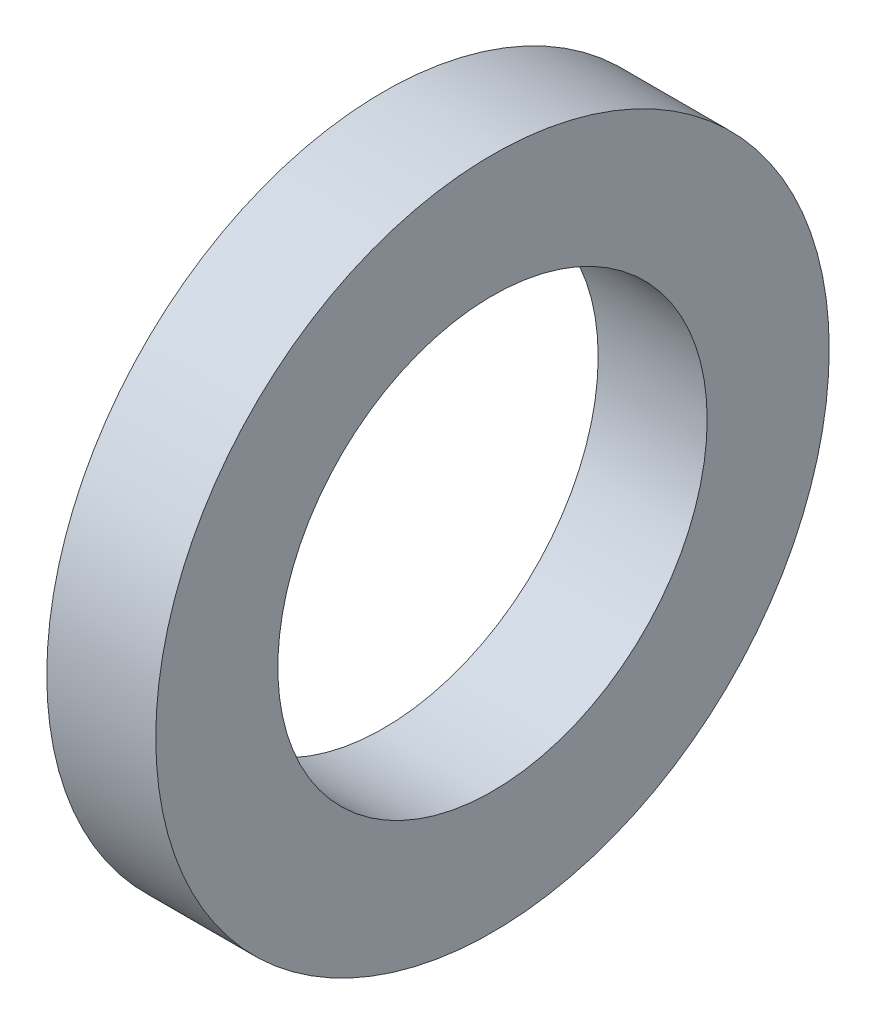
ISO-10303-21;
HEADER;
FILE_DESCRIPTION(('STEP AP214'),'2;1');
FILE_NAME('part.step','',(''),(''),'','','');
FILE_SCHEMA(('AUTOMOTIVE_DESIGN { 1 0 10303 214 1 1 1 1 }'));
ENDSEC;
DATA;
#1=APPLICATION_CONTEXT('core data for automotive mechanical design processes');
#2=APPLICATION_PROTOCOL_DEFINITION('international standard','automotive_design',2000,#1);
#3=PRODUCT_CONTEXT('',#1,'mechanical');
#4=PRODUCT('Part','Part','',(#3));
#5=PRODUCT_RELATED_PRODUCT_CATEGORY('part','',(#4));
#6=PRODUCT_DEFINITION_FORMATION('','',#4);
#7=PRODUCT_DEFINITION_CONTEXT('part definition',#1,'design');
#8=PRODUCT_DEFINITION('design','',#6,#7);
#9=PRODUCT_DEFINITION_SHAPE('','',#8);
#10=(LENGTH_UNIT() NAMED_UNIT(*) SI_UNIT(.MILLI.,.METRE.));
#11=(NAMED_UNIT(*) PLANE_ANGLE_UNIT() SI_UNIT($,.RADIAN.));
#12=(NAMED_UNIT(*) SI_UNIT($,.STERADIAN.) SOLID_ANGLE_UNIT());
#13=UNCERTAINTY_MEASURE_WITH_UNIT(LENGTH_MEASURE(1.E-05),#10,'distance_accuracy_value','');
#14=(GEOMETRIC_REPRESENTATION_CONTEXT(3) GLOBAL_UNCERTAINTY_ASSIGNED_CONTEXT((#13)) GLOBAL_UNIT_ASSIGNED_CONTEXT((#10,
#11,#12)) REPRESENTATION_CONTEXT('',''));
#15=CARTESIAN_POINT('',(0.,0.,0.));
#16=DIRECTION('',(0.,0.,1.));
#17=DIRECTION('',(1.,0.,0.));
#18=AXIS2_PLACEMENT_3D('',#15,#16,#17);
#19=CARTESIAN_POINT('',(6.35,0.,0.));
#20=DIRECTION('',(1.,0.,0.));
#21=DIRECTION('',(0.,0.,-1.));
#22=AXIS2_PLACEMENT_3D('',#19,#20,#21);
#23=PLANE('',#22);
#24=CARTESIAN_POINT('',(6.35,0.,0.));
#25=DIRECTION('',(1.,0.,0.));
#26=DIRECTION('',(0.,0.,-1.));
#27=AXIS2_PLACEMENT_3D('',#24,#25,#26);
#28=CIRCLE('',#27,19.6215);
#29=CARTESIAN_POINT('',(6.35,0.,-19.6215));
#30=VERTEX_POINT('',#29);
#31=EDGE_CURVE('E10',#30,#30,#28,.T.);
#32=ORIENTED_EDGE('',*,*,#31,.T.);
#33=EDGE_LOOP('',(#32));
#34=FACE_BOUND('',#33,.T.);
#35=CARTESIAN_POINT('',(6.35,0.,0.));
#36=DIRECTION('',(1.,0.,0.));
#37=DIRECTION('',(0.,0.,-1.));
#38=AXIS2_PLACEMENT_3D('',#35,#36,#37);
#39=CIRCLE('',#38,12.5095);
#40=CARTESIAN_POINT('',(6.35,0.,-12.5095));
#41=VERTEX_POINT('',#40);
#42=EDGE_CURVE('E41',#41,#41,#39,.T.);
#43=ORIENTED_EDGE('',*,*,#42,.F.);
#44=EDGE_LOOP('',(#43));
#45=FACE_BOUND('',#44,.T.);
#46=ADVANCED_FACE('F30',(#34,#45),#23,.T.);
#47=CARTESIAN_POINT('',(0.,0.,0.));
#48=DIRECTION('',(1.,0.,0.));
#49=DIRECTION('',(0.,0.,-1.));
#50=AXIS2_PLACEMENT_3D('',#47,#48,#49);
#51=PLANE('',#50);
#52=CARTESIAN_POINT('',(0.,0.,0.));
#53=DIRECTION('',(1.,0.,0.));
#54=DIRECTION('',(0.,0.,-1.));
#55=AXIS2_PLACEMENT_3D('',#52,#53,#54);
#56=CIRCLE('',#55,19.6215);
#57=CARTESIAN_POINT('',(0.,0.,-19.6215));
#58=VERTEX_POINT('',#57);
#59=EDGE_CURVE('E37',#58,#58,#56,.T.);
#60=ORIENTED_EDGE('',*,*,#59,.F.);
#61=EDGE_LOOP('',(#60));
#62=FACE_BOUND('',#61,.T.);
#63=CARTESIAN_POINT('',(0.,0.,0.));
#64=DIRECTION('',(1.,0.,0.));
#65=DIRECTION('',(0.,0.,-1.));
#66=AXIS2_PLACEMENT_3D('',#63,#64,#65);
#67=CIRCLE('',#66,12.5095);
#68=CARTESIAN_POINT('',(0.,0.,-12.5095));
#69=VERTEX_POINT('',#68);
#70=EDGE_CURVE('E45',#69,#69,#67,.T.);
#71=ORIENTED_EDGE('',*,*,#70,.T.);
#72=EDGE_LOOP('',(#71));
#73=FACE_BOUND('',#72,.T.);
#74=ADVANCED_FACE('F51',(#62,#73),#51,.F.);
#75=CARTESIAN_POINT('',(6.35,0.,0.));
#76=DIRECTION('',(-1.,0.,0.));
#77=DIRECTION('',(0.,0.,1.));
#78=AXIS2_PLACEMENT_3D('',#75,#76,#77);
#79=CYLINDRICAL_SURFACE('',#78,19.6215);
#80=ORIENTED_EDGE('',*,*,#31,.F.);
#81=EDGE_LOOP('',(#80));
#82=FACE_BOUND('',#81,.T.);
#83=ORIENTED_EDGE('',*,*,#59,.T.);
#84=EDGE_LOOP('',(#83));
#85=FACE_BOUND('',#84,.T.);
#86=ADVANCED_FACE('F32',(#82,#85),#79,.T.);
#87=CARTESIAN_POINT('',(6.35,0.,0.));
#88=DIRECTION('',(-1.,0.,0.));
#89=DIRECTION('',(0.,0.,1.));
#90=AXIS2_PLACEMENT_3D('',#87,#88,#89);
#91=CYLINDRICAL_SURFACE('',#90,12.5095);
#92=ORIENTED_EDGE('',*,*,#42,.T.);
#93=EDGE_LOOP('',(#92));
#94=FACE_BOUND('',#93,.T.);
#95=ORIENTED_EDGE('',*,*,#70,.F.);
#96=EDGE_LOOP('',(#95));
#97=FACE_BOUND('',#96,.T.);
#98=ADVANCED_FACE('F53',(#94,#97),#91,.F.);
#99=CLOSED_SHELL('',(#46,#74,#86,#98));
#100=MANIFOLD_SOLID_BREP('B2',#99);
#101=ADVANCED_BREP_SHAPE_REPRESENTATION('',(#18,#100),#14);
#102=SHAPE_DEFINITION_REPRESENTATION(#9,#101);
ENDSEC;
END-ISO-10303-21;
